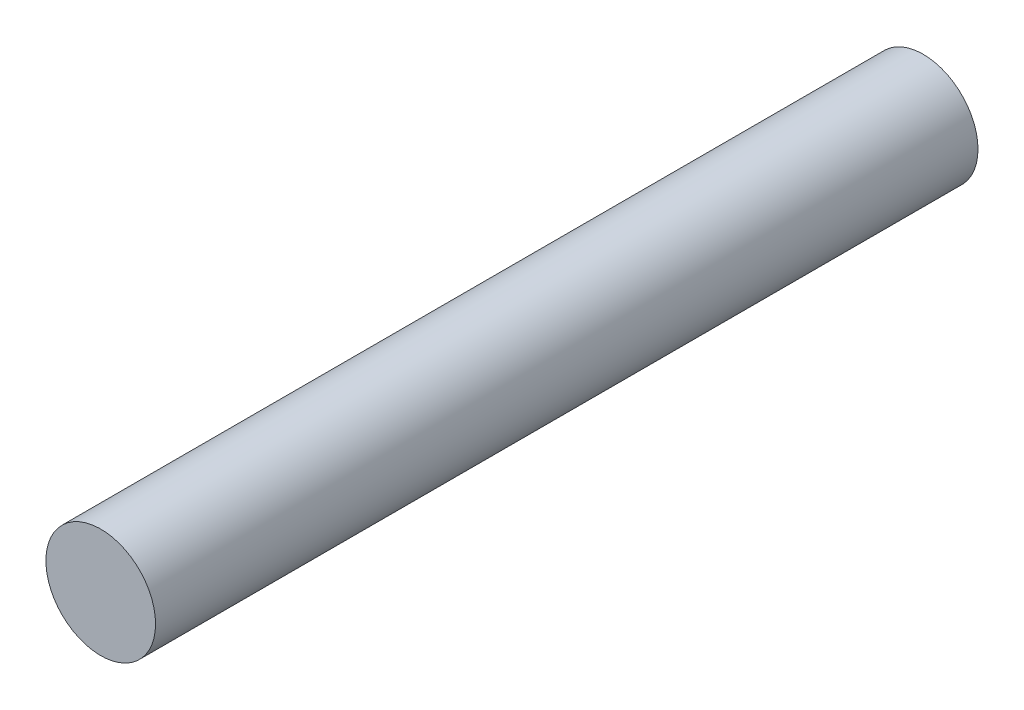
from build123d import *

# Parameters (mm, degrees)
SKIZZE1_R               = 20
LINEAR_AUSTRAGEN1_DEPTH = 300


with BuildPart() as part:
    # Skizze1 → Linear austragen1 (new body)
    with BuildSketch(Plane.XY):
        Circle(SKIZZE1_R)
    extrude(amount=LINEAR_AUSTRAGEN1_DEPTH)


solid = part.part
